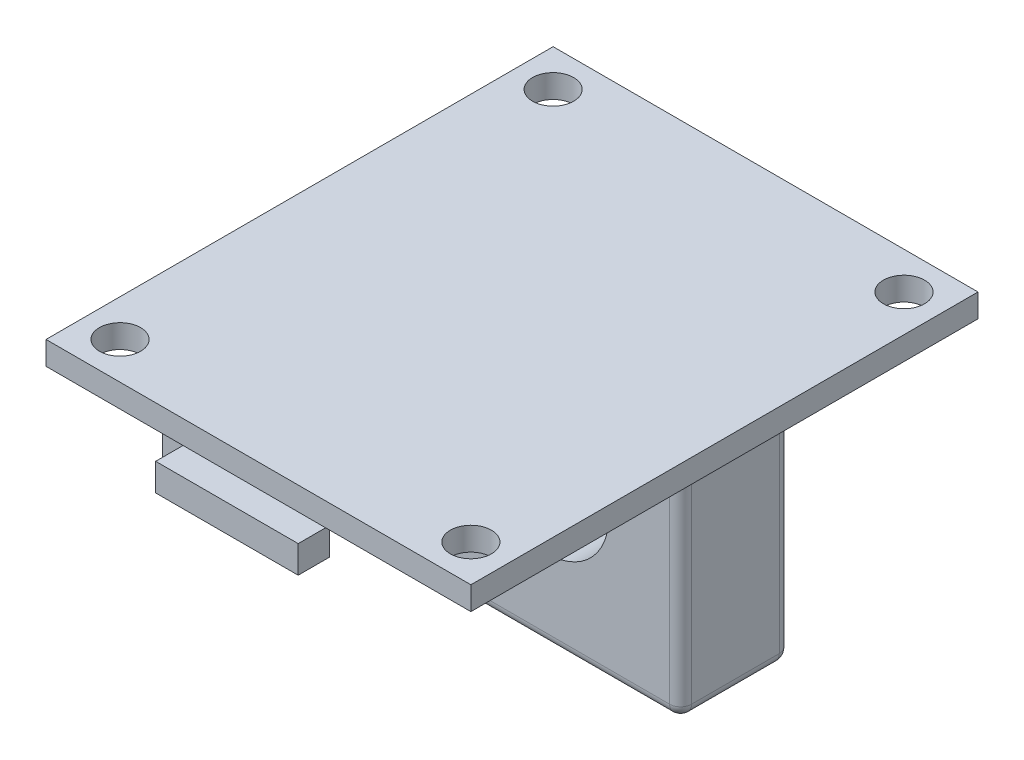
from build123d import *

# Parameters (mm, degrees)
SKETCH1_W               = 30.999999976
SKETCH1_H               = 37
BOSS_EXTRUDE1_DEPTH     = 1.7
CUT_EXTRUDE1_DEPTH      = 25.194834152
CUT_EXTRUDE1_DEPTH_BACK = 1.7
SKETCH2_R               = 1.5
SKETCH4_R               = 1.5
CUT_EXTRUDE2_DEPTH      = 1.7
SKETCH5_W               = 4.8
SKETCH5_H               = 9.5
BOSS_EXTRUDE2_DEPTH     = 10
SKETCH6_W               = 19.5
SKETCH6_H               = 8
BOSS_EXTRUDE3_DEPTH     = 20
FILLET1_R               = 0.8
SKETCH7_R               = 4.5
CUT_EXTRUDE3_DEPTH      = 20
SKETCH8_W               = 10.4
SKETCH8_H               = 2.3
BOSS_EXTRUDE4_DEPTH     = 2


with BuildPart() as part:
    # Sketch1 → Boss-Extrude1 (new body)
    with BuildSketch(Plane(origin=(0, 0, 0), x_dir=(1, 0, 0), z_dir=(0, 1, 0))):
        Rectangle(SKETCH1_W, SKETCH1_H)
    extrude(amount=BOSS_EXTRUDE1_DEPTH)

    # Sketch2 → Cut-Extrude1 (cut, two sides: drawn at the far end of the back side and taken through both)
    with BuildSketch(Plane(origin=(0, 0, 0), x_dir=(1, 0, 0), z_dir=(0, 1, 0)).offset(-CUT_EXTRUDE1_DEPTH_BACK)):
        with Locations(Location((-12.8, 15.8, 0), (0, 0, 270))):
            Circle(SKETCH2_R)
        with Locations(Location((12.8, 15.8, 0), (0, 0, 270))):
            Circle(SKETCH2_R)
    extrude(amount=CUT_EXTRUDE1_DEPTH + CUT_EXTRUDE1_DEPTH_BACK, mode=Mode.SUBTRACT)

    # Sketch4 → Cut-Extrude2 (cut)
    with BuildSketch(Plane(origin=(0, 0, 0), x_dir=(1, 0, 0), z_dir=(0, 1, 0))):
        with Locations(Location((-12.799999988, -15.8, 0), (0, 0, 270))):
            Circle(SKETCH4_R)
        with Locations(Location((12.799999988, -15.8, 0), (0, 0, 270))):
            Circle(SKETCH4_R)
    extrude(amount=CUT_EXTRUDE2_DEPTH, mode=Mode.SUBTRACT)

    # Sketch5 → Boss-Extrude2 (add)
    with BuildSketch(Plane(origin=(0, 0, 0), x_dir=(1, 0, 0), z_dir=(0, 1, 0))):
        with Locations((-12.299999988, -6.05)):
            Rectangle(SKETCH5_W, SKETCH5_H)
    extrude(amount=-BOSS_EXTRUDE2_DEPTH)

    # Sketch6 → Boss-Extrude3 (add)
    with BuildSketch(Plane(origin=(0, 0, 0), x_dir=(-1, 0, 0), z_dir=(0, -1, 0))):
        with Locations((-0.450000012, 6.1)):
            Rectangle(SKETCH6_W, SKETCH6_H)
    extrude(amount=BOSS_EXTRUDE3_DEPTH)

    # Fillet1
    fillet1_edges = [part.edges().sort_by_distance(p)[0] for p in [
        (-9.299999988, -10, -2.1),
        (-9.299999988, -10, -10.1),
        (10.200000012, -10, -10.1),
        (10.200000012, -10, -2.1),
        (-9.299999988, -20, -6.1),
        (0.450000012, -20, -10.1),
        (10.200000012, -20, -6.1),
        (0.450000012, -20, -2.1),
    ]]
    fillet(fillet1_edges, radius=FILLET1_R)

    # Sketch7 → Cut-Extrude3 (cut)
    with BuildSketch(Plane.XY):
        with Locations((0.450000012, -9.65326587)):
            Circle(SKETCH7_R)
    extrude(amount=-CUT_EXTRUDE3_DEPTH, mode=Mode.SUBTRACT)

    # Sketch8 → Boss-Extrude4 (add)
    with BuildSketch(Plane(origin=(0, 0, 0), x_dir=(-1, 0, 0), z_dir=(0, -1, 0))):
        with Locations((0.299999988, -19.35)):
            Rectangle(SKETCH8_W, SKETCH8_H)
    extrude(amount=BOSS_EXTRUDE4_DEPTH)


solid = part.part
